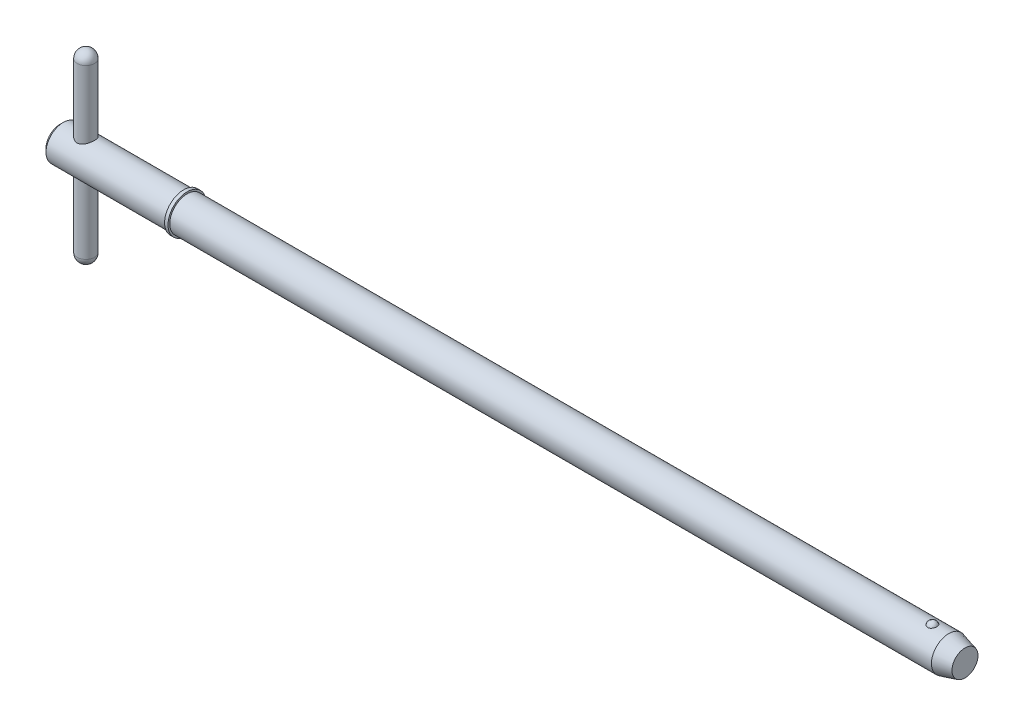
ISO-10303-21;
HEADER;
FILE_DESCRIPTION(('STEP AP214'),'2;1');
FILE_NAME('part.step','',(''),(''),'','','');
FILE_SCHEMA(('AUTOMOTIVE_DESIGN { 1 0 10303 214 1 1 1 1 }'));
ENDSEC;
DATA;
#1=APPLICATION_CONTEXT('core data for automotive mechanical design processes');
#2=APPLICATION_PROTOCOL_DEFINITION('international standard','automotive_design',2000,#1);
#3=PRODUCT_CONTEXT('',#1,'mechanical');
#4=PRODUCT('Part','Part','',(#3));
#5=PRODUCT_RELATED_PRODUCT_CATEGORY('part','',(#4));
#6=PRODUCT_DEFINITION_FORMATION('','',#4);
#7=PRODUCT_DEFINITION_CONTEXT('part definition',#1,'design');
#8=PRODUCT_DEFINITION('design','',#6,#7);
#9=PRODUCT_DEFINITION_SHAPE('','',#8);
#10=(LENGTH_UNIT() NAMED_UNIT(*) SI_UNIT(.MILLI.,.METRE.));
#11=(NAMED_UNIT(*) PLANE_ANGLE_UNIT() SI_UNIT($,.RADIAN.));
#12=(NAMED_UNIT(*) SI_UNIT($,.STERADIAN.) SOLID_ANGLE_UNIT());
#13=UNCERTAINTY_MEASURE_WITH_UNIT(LENGTH_MEASURE(1.E-05),#10,'distance_accuracy_value','');
#14=(GEOMETRIC_REPRESENTATION_CONTEXT(3) GLOBAL_UNCERTAINTY_ASSIGNED_CONTEXT((#13)) GLOBAL_UNIT_ASSIGNED_CONTEXT((#10,
#11,#12)) REPRESENTATION_CONTEXT('',''));
#15=CARTESIAN_POINT('',(0.,0.,0.));
#16=DIRECTION('',(0.,0.,1.));
#17=DIRECTION('',(1.,0.,0.));
#18=AXIS2_PLACEMENT_3D('',#15,#16,#17);
#19=CARTESIAN_POINT('',(3.57,12.7,0.));
#20=DIRECTION('',(0.,-1.,0.));
#21=DIRECTION('',(0.,0.,-1.));
#22=AXIS2_PLACEMENT_3D('',#19,#20,#21);
#23=CYLINDRICAL_SURFACE('',#22,1.19);
#24=CARTESIAN_POINT('',(3.57,-11.51,0.));
#25=DIRECTION('',(0.,-1.,0.));
#26=DIRECTION('',(0.,0.,-1.));
#27=AXIS2_PLACEMENT_3D('',#24,#25,#26);
#28=CIRCLE('',#27,1.19);
#29=CARTESIAN_POINT('',(3.57,-11.51,-1.19));
#30=VERTEX_POINT('',#29);
#31=EDGE_CURVE('P0_E10',#30,#30,#28,.F.);
#32=ORIENTED_EDGE('',*,*,#31,.T.);
#33=EDGE_LOOP('',(#32));
#34=FACE_BOUND('',#33,.T.);
#35=CARTESIAN_POINT('',(3.57,11.51,0.));
#36=DIRECTION('',(0.,-1.,0.));
#37=DIRECTION('',(0.,0.,-1.));
#38=AXIS2_PLACEMENT_3D('',#35,#36,#37);
#39=CIRCLE('',#38,1.19);
#40=CARTESIAN_POINT('',(3.57,11.51,-1.19));
#41=VERTEX_POINT('',#40);
#42=EDGE_CURVE('P0_E21',#41,#41,#39,.T.);
#43=ORIENTED_EDGE('',*,*,#42,.T.);
#44=EDGE_LOOP('',(#43));
#45=FACE_BOUND('',#44,.T.);
#46=ADVANCED_FACE('P0_F14',(#34,#45),#23,.T.);
#47=CARTESIAN_POINT('',(3.57,-11.51,0.));
#48=DIRECTION('',(0.,0.,1.));
#49=DIRECTION('',(1.,0.,0.));
#50=AXIS2_PLACEMENT_3D('',#47,#48,#49);
#51=SPHERICAL_SURFACE('',#50,1.19);
#52=CARTESIAN_POINT('',(3.57,-11.51,0.));
#53=DIRECTION('',(0.,-1.,0.));
#54=DIRECTION('',(0.,0.,-1.));
#55=AXIS2_PLACEMENT_3D('',#52,#53,#54);
#56=SPHERICAL_SURFACE('',#55,1.19);
#57=ORIENTED_EDGE('',*,*,#31,.F.);
#58=EDGE_LOOP('',(#57));
#59=FACE_BOUND('',#58,.T.);
#60=ADVANCED_FACE('P0_F29',(#59),#56,.T.);
#61=CARTESIAN_POINT('',(3.57,11.51,0.));
#62=DIRECTION('',(0.,0.,1.));
#63=DIRECTION('',(1.,0.,0.));
#64=AXIS2_PLACEMENT_3D('',#61,#62,#63);
#65=SPHERICAL_SURFACE('',#64,1.19);
#66=CARTESIAN_POINT('',(3.57,11.51,0.));
#67=DIRECTION('',(0.,-1.,0.));
#68=DIRECTION('',(0.,0.,-1.));
#69=AXIS2_PLACEMENT_3D('',#66,#67,#68);
#70=SPHERICAL_SURFACE('',#69,1.19);
#71=ORIENTED_EDGE('',*,*,#42,.F.);
#72=EDGE_LOOP('',(#71));
#73=FACE_BOUND('',#72,.T.);
#74=ADVANCED_FACE('P0_F16',(#73),#70,.T.);
#75=CLOSED_SHELL('',(#46,#60,#74));
#76=MANIFOLD_SOLID_BREP('P0_B1',#75);
#77=CARTESIAN_POINT('',(0.,0.,0.));
#78=DIRECTION('',(1.,0.,0.));
#79=DIRECTION('',(0.,0.,-1.));
#80=AXIS2_PLACEMENT_3D('',#77,#78,#79);
#81=CYLINDRICAL_SURFACE('',#80,2.38);
#82=CARTESIAN_POINT('',(121.909429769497,0.,0.));
#83=DIRECTION('',(1.,0.,0.));
#84=DIRECTION('',(0.,0.,-1.));
#85=AXIS2_PLACEMENT_3D('',#82,#83,#84);
#86=CIRCLE('',#85,2.38);
#87=CARTESIAN_POINT('',(121.909429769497,0.,-2.38));
#88=VERTEX_POINT('',#87);
#89=EDGE_CURVE('P1_E81',#88,#88,#86,.T.);
#90=ORIENTED_EDGE('',*,*,#89,.F.);
#91=EDGE_LOOP('',(#90));
#92=FACE_BOUND('',#91,.T.);
#93=CARTESIAN_POINT('',(17.45,0.,0.));
#94=DIRECTION('',(1.,0.,0.));
#95=DIRECTION('',(0.,0.,-1.));
#96=AXIS2_PLACEMENT_3D('',#93,#94,#95);
#97=CIRCLE('',#96,2.38);
#98=CARTESIAN_POINT('',(17.45,0.,-2.38));
#99=VERTEX_POINT('',#98);
#100=EDGE_CURVE('P1_E85',#99,#99,#97,.T.);
#101=ORIENTED_EDGE('',*,*,#100,.T.);
#102=EDGE_LOOP('',(#101));
#103=FACE_BOUND('',#102,.T.);
#104=CARTESIAN_POINT('',(119.663449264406,2.2921568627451,0.640637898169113));
#105=CARTESIAN_POINT('',(119.630355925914,2.29215737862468,0.64063719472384));
#106=CARTESIAN_POINT('',(119.597254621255,2.29293179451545,0.637884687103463));
#107=CARTESIAN_POINT('',(119.532017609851,2.29594030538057,0.626968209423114));
#108=CARTESIAN_POINT('',(119.499882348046,2.29817506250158,0.618801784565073));
#109=CARTESIAN_POINT('',(119.437540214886,2.3038430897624,0.597351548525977));
#110=CARTESIAN_POINT('',(119.40733051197,2.30727454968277,0.584075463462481));
#111=CARTESIAN_POINT('',(119.349567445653,2.31495941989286,0.552829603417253));
#112=CARTESIAN_POINT('',(119.32201418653,2.31921286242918,0.534859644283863));
#113=CARTESIAN_POINT('',(119.269593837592,2.32820213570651,0.494282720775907));
#114=CARTESIAN_POINT('',(119.244805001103,2.33294694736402,0.471576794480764));
#115=CARTESIAN_POINT('',(119.199216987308,2.34234144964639,0.422446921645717));
#116=CARTESIAN_POINT('',(119.178418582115,2.34699112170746,0.396022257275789));
#117=CARTESIAN_POINT('',(119.14035804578,2.35593942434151,0.338855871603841));
#118=CARTESIAN_POINT('',(119.123305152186,2.36021170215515,0.307970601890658));
#119=CARTESIAN_POINT('',(119.0943607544,2.3677057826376,0.243750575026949));
#120=CARTESIAN_POINT('',(119.0824701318,2.37092740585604,0.210415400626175));
#121=CARTESIAN_POINT('',(119.063807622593,2.37606901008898,0.141189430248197));
#122=CARTESIAN_POINT('',(119.057195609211,2.37794816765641,0.105252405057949));
#123=CARTESIAN_POINT('',(119.049809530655,2.38005135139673,0.032735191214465));
#124=CARTESIAN_POINT('',(119.049035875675,2.38027526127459,-0.00384504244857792));
#125=CARTESIAN_POINT('',(119.053362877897,2.37903842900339,-0.0769838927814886));
#126=CARTESIAN_POINT('',(119.05852028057,2.37756141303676,-0.113538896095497));
#127=CARTESIAN_POINT('',(119.074701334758,2.37305303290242,-0.185229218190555));
#128=CARTESIAN_POINT('',(119.085725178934,2.37002161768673,-0.220364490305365));
#129=CARTESIAN_POINT('',(119.113397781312,2.36273722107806,-0.288156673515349));
#130=CARTESIAN_POINT('',(119.130038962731,2.35848588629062,-0.320816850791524));
#131=CARTESIAN_POINT('',(119.168598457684,2.34923130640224,-0.382744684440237));
#132=CARTESIAN_POINT('',(119.190516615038,2.34422808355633,-0.412012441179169));
#133=CARTESIAN_POINT('',(119.238754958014,2.33412555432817,-0.465830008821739));
#134=CARTESIAN_POINT('',(119.265002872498,2.32902887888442,-0.490444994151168));
#135=CARTESIAN_POINT('',(119.321476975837,2.31926941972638,-0.534700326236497));
#136=CARTESIAN_POINT('',(119.351702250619,2.3146065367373,-0.554341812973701));
#137=CARTESIAN_POINT('',(119.414061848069,2.30645675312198,-0.587312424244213));
#138=CARTESIAN_POINT('',(119.446078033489,2.30293152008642,-0.600855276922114));
#139=CARTESIAN_POINT('',(119.512079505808,2.29725171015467,-0.622220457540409));
#140=CARTESIAN_POINT('',(119.546064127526,2.29509667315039,-0.630044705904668));
#141=CARTESIAN_POINT('',(119.613299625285,2.29249264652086,-0.639452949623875));
#142=CARTESIAN_POINT('',(119.646508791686,2.29196755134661,-0.641315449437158));
#143=CARTESIAN_POINT('',(119.712763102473,2.29246849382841,-0.63952261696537));
#144=CARTESIAN_POINT('',(119.745808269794,2.29349430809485,-0.635868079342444));
#145=CARTESIAN_POINT('',(119.810102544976,2.29694059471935,-0.623301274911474));
#146=CARTESIAN_POINT('',(119.841374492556,2.29933234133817,-0.614497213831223));
#147=CARTESIAN_POINT('',(119.901995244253,2.30522511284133,-0.592006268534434));
#148=CARTESIAN_POINT('',(119.931343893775,2.30872622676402,-0.578318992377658));
#149=CARTESIAN_POINT('',(119.988036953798,2.31655795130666,-0.546112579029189));
#150=CARTESIAN_POINT('',(120.015320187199,2.32090569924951,-0.52749010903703));
#151=CARTESIAN_POINT('',(120.066490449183,2.3299220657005,-0.486117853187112));
#152=CARTESIAN_POINT('',(120.090376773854,2.33459075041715,-0.463367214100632));
#153=CARTESIAN_POINT('',(120.135272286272,2.34399834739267,-0.41322006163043));
#154=CARTESIAN_POINT('',(120.156097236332,2.34873051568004,-0.38565730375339));
#155=CARTESIAN_POINT('',(120.193056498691,2.35754932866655,-0.327455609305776));
#156=CARTESIAN_POINT('',(120.209189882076,2.36163584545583,-0.296816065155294));
#157=CARTESIAN_POINT('',(120.2369822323,2.36889321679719,-0.232047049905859));
#158=CARTESIAN_POINT('',(120.248445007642,2.37202275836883,-0.197828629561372));
#159=CARTESIAN_POINT('',(120.265752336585,2.37681926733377,-0.127900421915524));
#160=CARTESIAN_POINT('',(120.271596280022,2.37848607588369,-0.092190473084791));
#161=CARTESIAN_POINT('',(120.277605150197,2.38020024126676,-0.0196348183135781));
#162=CARTESIAN_POINT('',(120.27767043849,2.38021918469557,0.0172198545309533));
#163=CARTESIAN_POINT('',(120.271868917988,2.37856356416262,0.0904219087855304));
#164=CARTESIAN_POINT('',(120.266001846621,2.37688892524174,0.126769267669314));
#165=CARTESIAN_POINT('',(120.248425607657,2.37201688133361,0.198028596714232));
#166=CARTESIAN_POINT('',(120.236699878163,2.36881516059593,0.232936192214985));
#167=CARTESIAN_POINT('',(120.20763544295,2.36123444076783,0.300196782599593));
#168=CARTESIAN_POINT('',(120.190296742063,2.3568554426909,0.332549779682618));
#169=CARTESIAN_POINT('',(120.150535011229,2.34744667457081,0.39349541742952));
#170=CARTESIAN_POINT('',(120.128152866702,2.34242227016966,0.422115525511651));
#171=CARTESIAN_POINT('',(120.078739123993,2.33227293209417,0.475004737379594));
#172=CARTESIAN_POINT('',(120.051707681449,2.32714800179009,0.499273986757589));
#173=CARTESIAN_POINT('',(119.994498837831,2.31755359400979,0.542046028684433));
#174=CARTESIAN_POINT('',(119.96442973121,2.3130698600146,0.560690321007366));
#175=CARTESIAN_POINT('',(119.901386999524,2.30514125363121,0.592447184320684));
#176=CARTESIAN_POINT('',(119.868415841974,2.30169550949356,0.605564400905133));
#177=CARTESIAN_POINT('',(119.806842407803,2.29677744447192,0.623927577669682));
#178=CARTESIAN_POINT('',(119.778555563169,2.295058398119,0.630178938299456));
#179=CARTESIAN_POINT('',(119.721330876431,2.29274795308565,0.638534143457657));
#180=CARTESIAN_POINT('',(119.692393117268,2.29215641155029,0.640638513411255));
#181=CARTESIAN_POINT('',(119.663449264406,2.2921568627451,0.640637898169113));
#182=B_SPLINE_CURVE_WITH_KNOTS('',3,(#104,#105,#106,#107,#108,#109,#110,#111,#112,#113,#114,
#115,#116,#117,#118,#119,#120,#121,#122,#123,#124,#125,#126,#127,#128,#129,#130,#131,#132,#133,
#134,#135,#136,#137,#138,#139,#140,#141,#142,#143,#144,#145,#146,#147,#148,#149,#150,#151,#152,
#153,#154,#155,#156,#157,#158,#159,#160,#161,#162,#163,#164,#165,#166,#167,#168,#169,#170,#171,
#172,#173,#174,#175,#176,#177,#178,#179,#180,#181),.UNSPECIFIED.,.T.,.F.,(4,2,2,2,2,2,2,2,2,2,2,
2,2,2,2,2,2,2,2,2,2,2,2,2,2,2,2,2,2,2,2,2,2,2,2,2,2,2,4),(0.,0.0991724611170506,
0.198389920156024,0.297457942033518,0.396529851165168,0.497927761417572,0.59934527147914,
0.70547553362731,0.811623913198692,0.920876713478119,1.03013718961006,1.14045177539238,
1.25076998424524,1.36093998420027,1.47110672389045,1.57959248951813,1.68805336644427,
1.79234266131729,1.89659691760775,1.9959039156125,2.09519661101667,2.19247425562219,
2.2897597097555,2.38926978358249,2.48880044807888,2.59293588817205,2.69709193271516,
2.80525821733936,2.91343624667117,3.0234791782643,3.13352698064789,3.24388765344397,
3.35424823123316,3.46374443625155,3.5732369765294,3.67968690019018,3.78604717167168,
3.87279565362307,3.9595331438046),.UNSPECIFIED.);
#183=CARTESIAN_POINT('',(119.663449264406,2.2921568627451,0.640637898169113));
#184=VERTEX_POINT('',#183);
#185=EDGE_CURVE('P1_E35',#184,#184,#182,.T.);
#186=ORIENTED_EDGE('',*,*,#185,.T.);
#187=EDGE_LOOP('',(#186));
#188=FACE_BOUND('',#187,.T.);
#189=ADVANCED_FACE('P1_F13',(#92,#103,#188),#81,.T.);
#190=CARTESIAN_POINT('',(0.,0.,0.));
#191=DIRECTION('',(-1.,0.,0.));
#192=DIRECTION('',(0.,0.,1.));
#193=AXIS2_PLACEMENT_3D('',#190,#191,#192);
#194=PLANE('',#193);
#195=CARTESIAN_POINT('',(0.,0.,0.));
#196=DIRECTION('',(1.,0.,0.));
#197=DIRECTION('',(0.,0.,-1.));
#198=AXIS2_PLACEMENT_3D('',#195,#196,#197);
#199=CIRCLE('',#198,1.904);
#200=CARTESIAN_POINT('',(0.,0.,-1.904));
#201=VERTEX_POINT('',#200);
#202=EDGE_CURVE('P1_E9',#201,#201,#199,.T.);
#203=ORIENTED_EDGE('',*,*,#202,.F.);
#204=EDGE_LOOP('',(#203));
#205=FACE_BOUND('',#204,.T.);
#206=ADVANCED_FACE('P1_F15',(#205),#194,.T.);
#207=CARTESIAN_POINT('',(0.475999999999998,0.,0.));
#208=DIRECTION('',(1.,0.,0.));
#209=DIRECTION('',(0.,0.,-1.));
#210=AXIS2_PLACEMENT_3D('',#207,#208,#209);
#211=CONICAL_SURFACE('',#210,2.38,0.78539816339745);
#212=ORIENTED_EDGE('',*,*,#202,.T.);
#213=EDGE_LOOP('',(#212));
#214=FACE_BOUND('',#213,.T.);
#215=CARTESIAN_POINT('',(0.475999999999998,0.,0.));
#216=DIRECTION('',(1.,0.,0.));
#217=DIRECTION('',(0.,0.,-1.));
#218=AXIS2_PLACEMENT_3D('',#215,#216,#217);
#219=CIRCLE('',#218,2.38);
#220=CARTESIAN_POINT('',(0.475999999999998,0.,-2.38));
#221=VERTEX_POINT('',#220);
#222=EDGE_CURVE('P1_E26',#221,#221,#219,.T.);
#223=ORIENTED_EDGE('',*,*,#222,.F.);
#224=EDGE_LOOP('',(#223));
#225=FACE_BOUND('',#224,.T.);
#226=ADVANCED_FACE('P1_F77',(#214,#225),#211,.T.);
#227=CARTESIAN_POINT('',(0.,0.,0.));
#228=DIRECTION('',(1.,0.,0.));
#229=DIRECTION('',(0.,0.,-1.));
#230=AXIS2_PLACEMENT_3D('',#227,#228,#229);
#231=CYLINDRICAL_SURFACE('',#230,2.38);
#232=CARTESIAN_POINT('',(3.57,-2.06114046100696,1.19));
#233=CARTESIAN_POINT('',(3.50799170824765,-2.06114586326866,1.18999567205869));
#234=CARTESIAN_POINT('',(3.4459051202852,-2.0639812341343,1.18512096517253));
#235=CARTESIAN_POINT('',(3.32363755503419,-2.07491216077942,1.16587061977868));
#236=CARTESIAN_POINT('',(3.26346086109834,-2.08301876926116,1.15147501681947));
#237=CARTESIAN_POINT('',(3.14701251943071,-2.10331722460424,1.11395893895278));
#238=CARTESIAN_POINT('',(3.09072196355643,-2.1154873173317,1.09088484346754));
#239=CARTESIAN_POINT('',(2.9828251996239,-2.14250771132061,1.03680835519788));
#240=CARTESIAN_POINT('',(2.93121924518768,-2.15735815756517,1.00580553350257));
#241=CARTESIAN_POINT('',(2.82945618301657,-2.18956274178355,0.933753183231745));
#242=CARTESIAN_POINT('',(2.77976962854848,-2.20702235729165,0.892085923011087));
#243=CARTESIAN_POINT('',(2.68772401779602,-2.2416265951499,0.801172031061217));
#244=CARTESIAN_POINT('',(2.64536861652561,-2.25877105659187,0.751921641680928));
#245=CARTESIAN_POINT('',(2.56639309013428,-2.29219557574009,0.64318258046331));
#246=CARTESIAN_POINT('',(2.53035201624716,-2.30833946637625,0.583227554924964));
#247=CARTESIAN_POINT('',(2.46908238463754,-2.3365739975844,0.45714686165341));
#248=CARTESIAN_POINT('',(2.44384700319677,-2.34866719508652,0.391025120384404));
#249=CARTESIAN_POINT('',(2.40676945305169,-2.36667748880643,0.259473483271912));
#250=CARTESIAN_POINT('',(2.39410206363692,-2.37297281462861,0.194329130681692));
#251=CARTESIAN_POINT('',(2.3798023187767,-2.3800902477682,0.0625590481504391));
#252=CARTESIAN_POINT('',(2.37816328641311,-2.38091566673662,-0.00406576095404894));
#253=CARTESIAN_POINT('',(2.38564854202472,-2.37717948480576,-0.130700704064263));
#254=CARTESIAN_POINT('',(2.39384923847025,-2.37308010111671,-0.190782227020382));
#255=CARTESIAN_POINT('',(2.41912820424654,-2.360653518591,-0.308583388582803));
#256=CARTESIAN_POINT('',(2.43620713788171,-2.35232600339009,-0.366302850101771));
#257=CARTESIAN_POINT('',(2.47886825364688,-2.33206184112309,-0.478748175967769));
#258=CARTESIAN_POINT('',(2.50456481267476,-2.32007685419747,-0.533421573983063));
#259=CARTESIAN_POINT('',(2.56357346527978,-2.29357798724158,-0.637812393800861));
#260=CARTESIAN_POINT('',(2.5968882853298,-2.27906320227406,-0.687528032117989));
#261=CARTESIAN_POINT('',(2.67380546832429,-2.24724829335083,-0.785606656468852));
#262=CARTESIAN_POINT('',(2.71808260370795,-2.22981457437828,-0.833397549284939));
#263=CARTESIAN_POINT('',(2.81386177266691,-2.19500665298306,-0.921184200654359));
#264=CARTESIAN_POINT('',(2.86536931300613,-2.17763250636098,-0.961173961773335));
#265=CARTESIAN_POINT('',(2.97815134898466,-2.14371545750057,-1.03471134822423));
#266=CARTESIAN_POINT('',(3.03983836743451,-2.12729540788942,-1.06768860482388));
#267=CARTESIAN_POINT('',(3.16889582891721,-2.09886785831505,-1.12254974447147));
#268=CARTESIAN_POINT('',(3.2362602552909,-2.0868557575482,-1.14444520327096));
#269=CARTESIAN_POINT('',(3.36914526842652,-2.06994116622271,-1.1747444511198));
#270=CARTESIAN_POINT('',(3.43438893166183,-2.06455070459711,-1.18407989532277));
#271=CARTESIAN_POINT('',(3.56571759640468,-2.06010324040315,-1.1918051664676));
#272=CARTESIAN_POINT('',(3.63180197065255,-2.06104176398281,-1.19020272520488));
#273=CARTESIAN_POINT('',(3.75522816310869,-2.06862860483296,-1.17695289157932));
#274=CARTESIAN_POINT('',(3.81273554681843,-2.07464109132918,-1.16642350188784));
#275=CARTESIAN_POINT('',(3.92505766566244,-2.09075885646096,-1.1372785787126));
#276=CARTESIAN_POINT('',(3.97987152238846,-2.1008654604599,-1.1186604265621));
#277=CARTESIAN_POINT('',(4.08813948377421,-2.12458104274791,-1.07296063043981));
#278=CARTESIAN_POINT('',(4.14141303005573,-2.13833055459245,-1.04552693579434));
#279=CARTESIAN_POINT('',(4.2429084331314,-2.16765782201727,-0.983281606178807));
#280=CARTESIAN_POINT('',(4.29112767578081,-2.18323651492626,-0.948466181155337));
#281=CARTESIAN_POINT('',(4.38750473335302,-2.2168271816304,-0.867316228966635));
#282=CARTESIAN_POINT('',(4.43488860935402,-2.23489833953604,-0.82008287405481));
#283=CARTESIAN_POINT('',(4.52130056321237,-2.26973739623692,-0.718051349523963));
#284=CARTESIAN_POINT('',(4.56032581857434,-2.28650485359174,-0.663250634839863));
#285=CARTESIAN_POINT('',(4.62978273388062,-2.31742220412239,-0.545657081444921));
#286=CARTESIAN_POINT('',(4.65996041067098,-2.33149133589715,-0.482691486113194));
#287=CARTESIAN_POINT('',(4.7089941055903,-2.35481192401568,-0.351671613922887));
#288=CARTESIAN_POINT('',(4.7278600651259,-2.36406760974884,-0.283621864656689));
#289=CARTESIAN_POINT('',(4.75210859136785,-2.3760433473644,-0.151105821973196));
#290=CARTESIAN_POINT('',(4.75856947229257,-2.37928514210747,-0.0868836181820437));
#291=CARTESIAN_POINT('',(4.76100348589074,-2.38050135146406,0.0417999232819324));
#292=CARTESIAN_POINT('',(4.75698028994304,-2.37847760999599,0.106261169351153));
#293=CARTESIAN_POINT('',(4.73927447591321,-2.36969422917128,0.229120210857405));
#294=CARTESIAN_POINT('',(4.72624582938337,-2.36325544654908,0.287637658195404));
#295=CARTESIAN_POINT('',(4.69178087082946,-2.34658591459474,0.401560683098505));
#296=CARTESIAN_POINT('',(4.67034335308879,-2.33635462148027,0.456965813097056));
#297=CARTESIAN_POINT('',(4.61871480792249,-2.31247857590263,0.565753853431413));
#298=CARTESIAN_POINT('',(4.58818860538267,-2.29870654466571,0.618948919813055));
#299=CARTESIAN_POINT('',(4.51967006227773,-2.26918878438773,0.719681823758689));
#300=CARTESIAN_POINT('',(4.48167429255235,-2.25344215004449,0.76721704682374));
#301=CARTESIAN_POINT('',(4.39491140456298,-2.21969046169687,0.860267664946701));
#302=CARTESIAN_POINT('',(4.34544863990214,-2.20161660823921,0.905111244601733));
#303=CARTESIAN_POINT('',(4.23943364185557,-2.16655060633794,0.986109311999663));
#304=CARTESIAN_POINT('',(4.18287520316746,-2.1495594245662,1.02225611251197));
#305=CARTESIAN_POINT('',(4.06190239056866,-2.1181953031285,1.08579298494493));
#306=CARTESIAN_POINT('',(3.9972962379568,-2.10392207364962,1.11287022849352));
#307=CARTESIAN_POINT('',(3.86353443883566,-2.08090726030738,1.15534566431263));
#308=CARTESIAN_POINT('',(3.7943948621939,-2.07214719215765,1.17078291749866));
#309=CARTESIAN_POINT('',(3.69875162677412,-2.06499834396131,1.18329673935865));
#310=CARTESIAN_POINT('',(3.67309220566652,-2.06355673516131,1.18580656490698));
#311=CARTESIAN_POINT('',(3.62162638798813,-2.06162663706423,1.18915915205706));
#312=CARTESIAN_POINT('',(3.59581998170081,-2.0611382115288,1.19000180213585));
#313=CARTESIAN_POINT('',(3.57,-2.06114046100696,1.19));
#314=B_SPLINE_CURVE_WITH_KNOTS('',3,(#232,#233,#234,#235,#236,#237,#238,#239,#240,#241,#242,
#243,#244,#245,#246,#247,#248,#249,#250,#251,#252,#253,#254,#255,#256,#257,#258,#259,#260,#261,
#262,#263,#264,#265,#266,#267,#268,#269,#270,#271,#272,#273,#274,#275,#276,#277,#278,#279,#280,
#281,#282,#283,#284,#285,#286,#287,#288,#289,#290,#291,#292,#293,#294,#295,#296,#297,#298,#299,
#300,#301,#302,#303,#304,#305,#306,#307,#308,#309,#310,#311,#312,#313),.UNSPECIFIED.,.T.,.F.,(4,
2,2,2,2,2,2,2,2,2,2,2,2,2,2,2,2,2,2,2,2,2,2,2,2,2,2,2,2,2,2,2,2,2,2,2,2,2,2,2,4),(0.,
0.185916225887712,0.372223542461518,0.557549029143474,0.742884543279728,0.943506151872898,
1.14422749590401,1.35847891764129,1.5725948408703,1.77147547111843,1.97023568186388,
2.15171156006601,2.33320101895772,2.51720146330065,2.70126786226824,2.902733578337,
3.10435357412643,3.31877721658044,3.53297641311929,3.73020126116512,3.92728670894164,
4.1028127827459,4.27839572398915,4.46211082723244,4.64592048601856,4.8529002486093,
5.0599497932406,5.27246375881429,5.48479067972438,5.67763601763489,5.87041383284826,
6.05048865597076,6.23058930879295,6.41839293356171,6.60628297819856,6.8128718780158,
7.01964271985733,7.2329479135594,7.44553408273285,7.52294360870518,7.60035831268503),.UNSPECIFIED.);
#315=CARTESIAN_POINT('',(3.57,-2.06114046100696,1.19));
#316=VERTEX_POINT('',#315);
#317=EDGE_CURVE('P1_E17',#316,#316,#314,.T.);
#318=ORIENTED_EDGE('',*,*,#317,.F.);
#319=EDGE_LOOP('',(#318));
#320=FACE_BOUND('',#319,.T.);
#321=CARTESIAN_POINT('',(3.57,2.06114046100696,1.19));
#322=CARTESIAN_POINT('',(3.63200829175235,2.06114586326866,1.18999567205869));
#323=CARTESIAN_POINT('',(3.6940948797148,2.0639812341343,1.18512096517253));
#324=CARTESIAN_POINT('',(3.81636244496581,2.07491216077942,1.16587061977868));
#325=CARTESIAN_POINT('',(3.87653913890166,2.08301876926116,1.15147501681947));
#326=CARTESIAN_POINT('',(3.99298748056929,2.10331722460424,1.11395893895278));
#327=CARTESIAN_POINT('',(4.04927803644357,2.1154873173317,1.09088484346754));
#328=CARTESIAN_POINT('',(4.1571748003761,2.14250771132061,1.03680835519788));
#329=CARTESIAN_POINT('',(4.20878075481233,2.15735815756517,1.00580553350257));
#330=CARTESIAN_POINT('',(4.31054381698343,2.18956274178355,0.933753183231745));
#331=CARTESIAN_POINT('',(4.36023037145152,2.20702235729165,0.892085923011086));
#332=CARTESIAN_POINT('',(4.45227598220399,2.2416265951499,0.801172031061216));
#333=CARTESIAN_POINT('',(4.49463138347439,2.25877105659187,0.751921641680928));
#334=CARTESIAN_POINT('',(4.57360690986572,2.29219557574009,0.643182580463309));
#335=CARTESIAN_POINT('',(4.60964798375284,2.30833946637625,0.583227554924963));
#336=CARTESIAN_POINT('',(4.67091761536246,2.3365739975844,0.457146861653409));
#337=CARTESIAN_POINT('',(4.69615299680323,2.34866719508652,0.391025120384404));
#338=CARTESIAN_POINT('',(4.73323054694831,2.36667748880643,0.259473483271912));
#339=CARTESIAN_POINT('',(4.74589793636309,2.37297281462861,0.194329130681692));
#340=CARTESIAN_POINT('',(4.7601976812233,2.3800902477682,0.0625590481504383));
#341=CARTESIAN_POINT('',(4.76183671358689,2.38091566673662,-0.00406576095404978));
#342=CARTESIAN_POINT('',(4.75435145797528,2.37717948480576,-0.130700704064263));
#343=CARTESIAN_POINT('',(4.74615076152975,2.37308010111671,-0.190782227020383));
#344=CARTESIAN_POINT('',(4.72087179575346,2.360653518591,-0.308583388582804));
#345=CARTESIAN_POINT('',(4.70379286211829,2.35232600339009,-0.366302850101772));
#346=CARTESIAN_POINT('',(4.66113174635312,2.33206184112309,-0.478748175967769));
#347=CARTESIAN_POINT('',(4.63543518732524,2.32007685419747,-0.533421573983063));
#348=CARTESIAN_POINT('',(4.57642653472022,2.29357798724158,-0.637812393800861));
#349=CARTESIAN_POINT('',(4.5431117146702,2.27906320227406,-0.687528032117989));
#350=CARTESIAN_POINT('',(4.46619453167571,2.24724829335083,-0.785606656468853));
#351=CARTESIAN_POINT('',(4.42191739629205,2.22981457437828,-0.83339754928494));
#352=CARTESIAN_POINT('',(4.32613822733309,2.19500665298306,-0.921184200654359));
#353=CARTESIAN_POINT('',(4.27463068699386,2.17763250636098,-0.961173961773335));
#354=CARTESIAN_POINT('',(4.16184865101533,2.14371545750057,-1.03471134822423));
#355=CARTESIAN_POINT('',(4.10016163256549,2.12729540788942,-1.06768860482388));
#356=CARTESIAN_POINT('',(3.97110417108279,2.09886785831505,-1.12254974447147));
#357=CARTESIAN_POINT('',(3.9037397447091,2.0868557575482,-1.14444520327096));
#358=CARTESIAN_POINT('',(3.77085473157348,2.06994116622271,-1.1747444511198));
#359=CARTESIAN_POINT('',(3.70561106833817,2.06455070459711,-1.18407989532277));
#360=CARTESIAN_POINT('',(3.57428240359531,2.06010324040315,-1.1918051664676));
#361=CARTESIAN_POINT('',(3.50819802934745,2.06104176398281,-1.19020272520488));
#362=CARTESIAN_POINT('',(3.38477183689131,2.06862860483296,-1.17695289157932));
#363=CARTESIAN_POINT('',(3.32726445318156,2.07464109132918,-1.16642350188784));
#364=CARTESIAN_POINT('',(3.21494233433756,2.09075885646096,-1.1372785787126));
#365=CARTESIAN_POINT('',(3.16012847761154,2.1008654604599,-1.1186604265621));
#366=CARTESIAN_POINT('',(3.05186051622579,2.12458104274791,-1.07296063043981));
#367=CARTESIAN_POINT('',(2.99858696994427,2.13833055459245,-1.04552693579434));
#368=CARTESIAN_POINT('',(2.8970915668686,2.16765782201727,-0.983281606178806));
#369=CARTESIAN_POINT('',(2.84887232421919,2.18323651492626,-0.948466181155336));
#370=CARTESIAN_POINT('',(2.75249526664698,2.2168271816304,-0.867316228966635));
#371=CARTESIAN_POINT('',(2.70511139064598,2.23489833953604,-0.820082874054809));
#372=CARTESIAN_POINT('',(2.61869943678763,2.26973739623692,-0.718051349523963));
#373=CARTESIAN_POINT('',(2.57967418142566,2.28650485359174,-0.663250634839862));
#374=CARTESIAN_POINT('',(2.51021726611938,2.31742220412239,-0.54565708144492));
#375=CARTESIAN_POINT('',(2.48003958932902,2.33149133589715,-0.482691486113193));
#376=CARTESIAN_POINT('',(2.4310058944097,2.35481192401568,-0.351671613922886));
#377=CARTESIAN_POINT('',(2.4121399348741,2.36406760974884,-0.283621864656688));
#378=CARTESIAN_POINT('',(2.38789140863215,2.3760433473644,-0.151105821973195));
#379=CARTESIAN_POINT('',(2.38143052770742,2.37928514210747,-0.0868836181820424));
#380=CARTESIAN_POINT('',(2.37899651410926,2.38050135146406,0.0417999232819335));
#381=CARTESIAN_POINT('',(2.38301971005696,2.37847760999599,0.106261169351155));
#382=CARTESIAN_POINT('',(2.40072552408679,2.36969422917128,0.229120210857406));
#383=CARTESIAN_POINT('',(2.41375417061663,2.36325544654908,0.287637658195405));
#384=CARTESIAN_POINT('',(2.44821912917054,2.34658591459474,0.401560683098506));
#385=CARTESIAN_POINT('',(2.46965664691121,2.33635462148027,0.456965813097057));
#386=CARTESIAN_POINT('',(2.52128519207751,2.31247857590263,0.565753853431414));
#387=CARTESIAN_POINT('',(2.55181139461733,2.29870654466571,0.618948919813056));
#388=CARTESIAN_POINT('',(2.62032993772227,2.26918878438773,0.719681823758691));
#389=CARTESIAN_POINT('',(2.65832570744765,2.25344215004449,0.767217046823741));
#390=CARTESIAN_POINT('',(2.74508859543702,2.21969046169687,0.860267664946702));
#391=CARTESIAN_POINT('',(2.79455136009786,2.20161660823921,0.905111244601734));
#392=CARTESIAN_POINT('',(2.90056635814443,2.16655060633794,0.986109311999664));
#393=CARTESIAN_POINT('',(2.95712479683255,2.1495594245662,1.02225611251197));
#394=CARTESIAN_POINT('',(3.07809760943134,2.1181953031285,1.08579298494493));
#395=CARTESIAN_POINT('',(3.1427037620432,2.10392207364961,1.11287022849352));
#396=CARTESIAN_POINT('',(3.27646556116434,2.08090726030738,1.15534566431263));
#397=CARTESIAN_POINT('',(3.3456051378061,2.07214719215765,1.17078291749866));
#398=CARTESIAN_POINT('',(3.44124837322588,2.06499834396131,1.18329673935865));
#399=CARTESIAN_POINT('',(3.46690779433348,2.06355673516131,1.18580656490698));
#400=CARTESIAN_POINT('',(3.51837361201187,2.06162663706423,1.18915915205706));
#401=CARTESIAN_POINT('',(3.54418001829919,2.0611382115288,1.19000180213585));
#402=CARTESIAN_POINT('',(3.57,2.06114046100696,1.19));
#403=B_SPLINE_CURVE_WITH_KNOTS('',3,(#321,#322,#323,#324,#325,#326,#327,#328,#329,#330,#331,
#332,#333,#334,#335,#336,#337,#338,#339,#340,#341,#342,#343,#344,#345,#346,#347,#348,#349,#350,
#351,#352,#353,#354,#355,#356,#357,#358,#359,#360,#361,#362,#363,#364,#365,#366,#367,#368,#369,
#370,#371,#372,#373,#374,#375,#376,#377,#378,#379,#380,#381,#382,#383,#384,#385,#386,#387,#388,
#389,#390,#391,#392,#393,#394,#395,#396,#397,#398,#399,#400,#401,#402),.UNSPECIFIED.,.T.,.F.,(4,
2,2,2,2,2,2,2,2,2,2,2,2,2,2,2,2,2,2,2,2,2,2,2,2,2,2,2,2,2,2,2,2,2,2,2,2,2,2,2,4),(0.,
0.185916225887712,0.372223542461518,0.557549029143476,0.74288454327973,0.9435061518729,
1.14422749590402,1.35847891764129,1.5725948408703,1.77147547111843,1.97023568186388,
2.15171156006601,2.33320101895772,2.51720146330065,2.70126786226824,2.902733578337,
3.10435357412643,3.31877721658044,3.53297641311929,3.73020126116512,3.92728670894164,
4.1028127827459,4.27839572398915,4.46211082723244,4.64592048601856,4.8529002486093,
5.05994979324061,5.27246375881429,5.48479067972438,5.67763601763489,5.87041383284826,
6.05048865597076,6.23058930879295,6.41839293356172,6.60628297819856,6.8128718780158,
7.01964271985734,7.2329479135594,7.44553408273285,7.52294360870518,7.60035831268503),.UNSPECIFIED.);
#404=CARTESIAN_POINT('',(3.57,2.06114046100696,1.19));
#405=VERTEX_POINT('',#404);
#406=EDGE_CURVE('P1_E43',#405,#405,#403,.T.);
#407=ORIENTED_EDGE('',*,*,#406,.F.);
#408=EDGE_LOOP('',(#407));
#409=FACE_BOUND('',#408,.T.);
#410=ORIENTED_EDGE('',*,*,#222,.T.);
#411=EDGE_LOOP('',(#410));
#412=FACE_BOUND('',#411,.T.);
#413=CARTESIAN_POINT('',(16.974,0.,0.));
#414=DIRECTION('',(1.,0.,0.));
#415=DIRECTION('',(0.,0.,-1.));
#416=AXIS2_PLACEMENT_3D('',#413,#414,#415);
#417=CIRCLE('',#416,2.38);
#418=CARTESIAN_POINT('',(16.974,0.,-2.38));
#419=VERTEX_POINT('',#418);
#420=EDGE_CURVE('P1_E31',#419,#419,#417,.T.);
#421=ORIENTED_EDGE('',*,*,#420,.F.);
#422=EDGE_LOOP('',(#421));
#423=FACE_BOUND('',#422,.T.);
#424=ADVANCED_FACE('P1_F103',(#320,#409,#412,#423),#231,.T.);
#425=CARTESIAN_POINT('',(16.974,2.38,0.));
#426=DIRECTION('',(-1.,0.,0.));
#427=DIRECTION('',(0.,0.,1.));
#428=AXIS2_PLACEMENT_3D('',#425,#426,#427);
#429=PLANE('',#428);
#430=ORIENTED_EDGE('',*,*,#420,.T.);
#431=EDGE_LOOP('',(#430));
#432=FACE_BOUND('',#431,.T.);
#433=CARTESIAN_POINT('',(16.974,0.,0.));
#434=DIRECTION('',(1.,0.,0.));
#435=DIRECTION('',(0.,0.,-1.));
#436=AXIS2_PLACEMENT_3D('',#433,#434,#435);
#437=CIRCLE('',#436,2.618);
#438=CARTESIAN_POINT('',(16.974,0.,-2.618));
#439=VERTEX_POINT('',#438);
#440=EDGE_CURVE('P1_E91',#439,#439,#437,.T.);
#441=ORIENTED_EDGE('',*,*,#440,.F.);
#442=EDGE_LOOP('',(#441));
#443=FACE_BOUND('',#442,.T.);
#444=ADVANCED_FACE('P1_F100',(#432,#443),#429,.T.);
#445=CARTESIAN_POINT('',(0.,0.,0.));
#446=DIRECTION('',(1.,0.,0.));
#447=DIRECTION('',(0.,0.,-1.));
#448=AXIS2_PLACEMENT_3D('',#445,#446,#447);
#449=CYLINDRICAL_SURFACE('',#448,2.618);
#450=ORIENTED_EDGE('',*,*,#440,.T.);
#451=EDGE_LOOP('',(#450));
#452=FACE_BOUND('',#451,.T.);
#453=CARTESIAN_POINT('',(17.45,0.,0.));
#454=DIRECTION('',(1.,0.,0.));
#455=DIRECTION('',(0.,0.,-1.));
#456=AXIS2_PLACEMENT_3D('',#453,#454,#455);
#457=CIRCLE('',#456,2.618);
#458=CARTESIAN_POINT('',(17.45,0.,-2.618));
#459=VERTEX_POINT('',#458);
#460=EDGE_CURVE('P1_E88',#459,#459,#457,.T.);
#461=ORIENTED_EDGE('',*,*,#460,.F.);
#462=EDGE_LOOP('',(#461));
#463=FACE_BOUND('',#462,.T.);
#464=ADVANCED_FACE('P1_F68',(#452,#463),#449,.T.);
#465=CARTESIAN_POINT('',(17.45,2.618,0.));
#466=DIRECTION('',(1.,0.,0.));
#467=DIRECTION('',(0.,0.,-1.));
#468=AXIS2_PLACEMENT_3D('',#465,#466,#467);
#469=PLANE('',#468);
#470=ORIENTED_EDGE('',*,*,#460,.T.);
#471=EDGE_LOOP('',(#470));
#472=FACE_BOUND('',#471,.T.);
#473=ORIENTED_EDGE('',*,*,#100,.F.);
#474=EDGE_LOOP('',(#473));
#475=FACE_BOUND('',#474,.T.);
#476=ADVANCED_FACE('P1_F62',(#472,#475),#469,.T.);
#477=CARTESIAN_POINT('',(124.13,0.,0.));
#478=DIRECTION('',(-1.,0.,0.));
#479=DIRECTION('',(0.,0.,1.));
#480=AXIS2_PLACEMENT_3D('',#477,#478,#479);
#481=CONICAL_SURFACE('',#480,1.78500000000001,0.261799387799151);
#482=ORIENTED_EDGE('',*,*,#89,.T.);
#483=EDGE_LOOP('',(#482));
#484=FACE_BOUND('',#483,.T.);
#485=CARTESIAN_POINT('',(124.13,0.,0.));
#486=DIRECTION('',(1.,0.,0.));
#487=DIRECTION('',(0.,0.,-1.));
#488=AXIS2_PLACEMENT_3D('',#485,#486,#487);
#489=CIRCLE('',#488,1.78500000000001);
#490=CARTESIAN_POINT('',(124.13,0.,-1.78500000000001));
#491=VERTEX_POINT('',#490);
#492=EDGE_CURVE('P1_E42',#491,#491,#489,.T.);
#493=ORIENTED_EDGE('',*,*,#492,.F.);
#494=EDGE_LOOP('',(#493));
#495=FACE_BOUND('',#494,.T.);
#496=ADVANCED_FACE('P1_F59',(#484,#495),#481,.T.);
#497=CARTESIAN_POINT('',(124.13,1.78500000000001,0.));
#498=DIRECTION('',(1.,0.,0.));
#499=DIRECTION('',(0.,0.,-1.));
#500=AXIS2_PLACEMENT_3D('',#497,#498,#499);
#501=PLANE('',#500);
#502=ORIENTED_EDGE('',*,*,#492,.T.);
#503=EDGE_LOOP('',(#502));
#504=FACE_BOUND('',#503,.T.);
#505=ADVANCED_FACE('P1_F55',(#504),#501,.T.);
#506=CARTESIAN_POINT('',(119.663449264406,2.142,0.));
#507=DIRECTION('',(-1.,0.,0.));
#508=DIRECTION('',(0.,1.,0.));
#509=AXIS2_PLACEMENT_3D('',#506,#507,#508);
#510=SPHERICAL_SURFACE('',#509,0.657999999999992);
#511=ORIENTED_EDGE('',*,*,#185,.F.);
#512=EDGE_LOOP('',(#511));
#513=FACE_BOUND('',#512,.T.);
#514=ADVANCED_FACE('P1_F50',(#513),#510,.T.);
#515=CARTESIAN_POINT('',(3.57,-2.618,0.));
#516=DIRECTION('',(0.,1.,0.));
#517=DIRECTION('',(0.,0.,1.));
#518=AXIS2_PLACEMENT_3D('',#515,#516,#517);
#519=CYLINDRICAL_SURFACE('',#518,1.19);
#520=ORIENTED_EDGE('',*,*,#317,.T.);
#521=EDGE_LOOP('',(#520));
#522=FACE_BOUND('',#521,.T.);
#523=ORIENTED_EDGE('',*,*,#406,.T.);
#524=EDGE_LOOP('',(#523));
#525=FACE_BOUND('',#524,.T.);
#526=ADVANCED_FACE('P1_F54',(#522,#525),#519,.F.);
#527=CLOSED_SHELL('',(#189,#206,#226,#424,#444,#464,#476,#496,#505,#514,#526));
#528=MANIFOLD_SOLID_BREP('P1_B1',#527);
#529=ADVANCED_BREP_SHAPE_REPRESENTATION('',(#18,#76,#528),#14);
#530=SHAPE_DEFINITION_REPRESENTATION(#9,#529);
ENDSEC;
END-ISO-10303-21;
